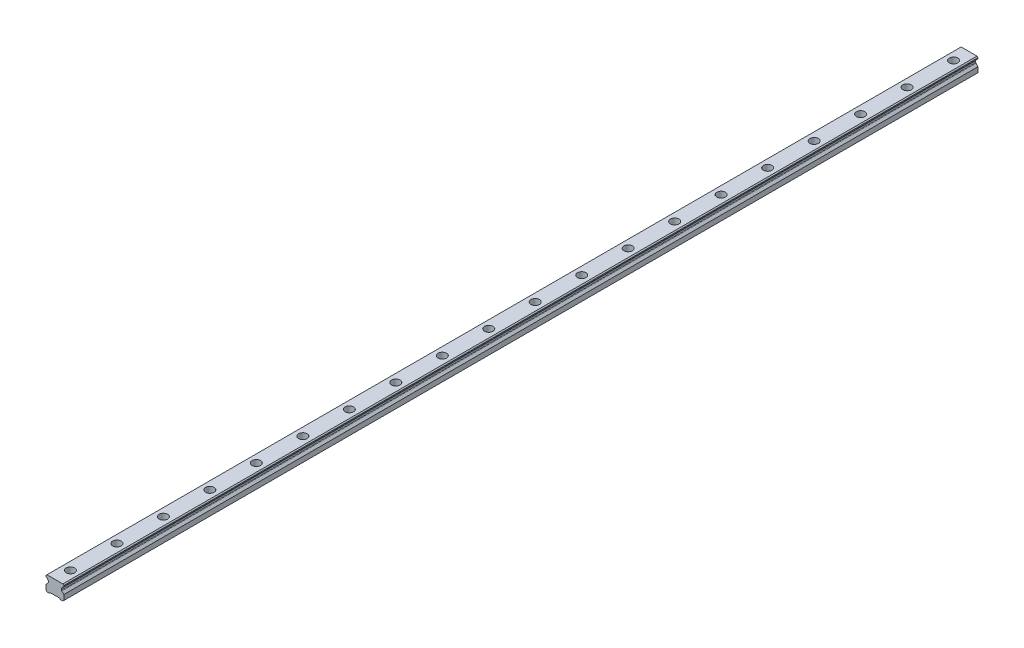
from build123d import *

# Parameters (mm, degrees)
SKETCH1_W           = 23
SKETCH1_H           = 19.2
BOSS_EXTRUDE1_DEPTH = 590
CUT_EXTRUDE1_DEPTH  = 1181.212222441
CHAMFER1_SIZE       = 1.25
FILLET1_R           = 1.25
CUT_EXTRUDE2_DEPTH  = 1181.212222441
SKETCH4_R           = 5.5
SKETCH4_R_2         = 3.5
CUT_EXTRUDE3_DEPTH  = 9
SKETCH4_2_R         = 3.5
CUT_EXTRUDE4_DEPTH  = 591.424330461
LPATTERN1_COUNT     = 20
LPATTERN1_PITCH     = 60


with BuildPart() as part:
    # Sketch1 → Boss-Extrude1 (new, symmetric)
    with BuildSketch(Plane.XY):
        with Locations((0, 9.6)):
            Rectangle(SKETCH1_W, SKETCH1_H)
    extrude(amount=BOSS_EXTRUDE1_DEPTH, both=True)

    # Sketch2 → Cut-Extrude1 (cut, through all)
    with BuildSketch(Plane.XY.offset(590)):
        Polygon((-11.5, 16.7), (-11.5, 7.95), (-8.583333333, 10.866666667), (-8.583333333, 13.783333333), align=None)
        Polygon((8.583333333, 13.783333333), (11.5, 16.7), (11.5, 7.95), (8.583333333, 10.866666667), align=None)
    extrude(amount=-CUT_EXTRUDE1_DEPTH, mode=Mode.SUBTRACT)

    # Chamfer1
    chamfer1_edges = [part.edges().sort_by_distance(p)[0] for p in [
        (-11.5, 19.2, 0),
        (11.5, 19.2, 0),
        (11.5, 0, 0),
        (-11.5, 0, 0),
    ]]
    chamfer(chamfer1_edges, length=CHAMFER1_SIZE)

    # Fillet1
    fillet1_edges = [part.edges().sort_by_distance(p)[0] for p in [
        (-8.583333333, 13.783333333, 0),
        (-8.583333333, 10.866666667, 0),
        (8.583333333, 10.866666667, 0),
        (8.583333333, 13.783333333, 0),
    ]]
    fillet(fillet1_edges, radius=FILLET1_R)

    # Sketch3 → Cut-Extrude2 (cut, through all)
    with BuildSketch(Plane.XY.offset(590)):
        Polygon((-7, 0), (-5.75, 1.25), (5.75, 1.25), (7, 0), align=None)
    extrude(amount=-CUT_EXTRUDE2_DEPTH, mode=Mode.SUBTRACT)

    # Sketch4 → Cut-Extrude3 (cut)
    with BuildSketch(Plane(origin=(0, 19.2, 0), x_dir=(1, 0, 0), z_dir=(0, 1, 0))):
        with Locations(Location((0, -570, 0), (0, 0, 270))):
            Circle(SKETCH4_R)
        with Locations(Location((0, -570, 0), (0, 0, 270))):
            Circle(SKETCH4_R_2, mode=Mode.SUBTRACT)
    cut_extrude3 = extrude(amount=-CUT_EXTRUDE3_DEPTH, mode=Mode.SUBTRACT)

    # Sketch4_2 → Cut-Extrude4 (cut, through all)
    with BuildSketch(Plane(origin=(0, 19.2, 0), x_dir=(1, 0, 0), z_dir=(0, 1, 0))):
        with Locations(Location((0, -570, 0), (0, 0, 270))):
            Circle(SKETCH4_2_R)
    cut_extrude4 = extrude(amount=-CUT_EXTRUDE4_DEPTH, mode=Mode.SUBTRACT)

    # LPattern1: Cut-Extrude3, Cut-Extrude4 ×20
    with Locations(*[(0, 0, -i * LPATTERN1_PITCH) for i in range(1, LPATTERN1_COUNT)]):
        add(cut_extrude3, mode=Mode.SUBTRACT)
        add(cut_extrude4, mode=Mode.SUBTRACT)


solid = part.part
